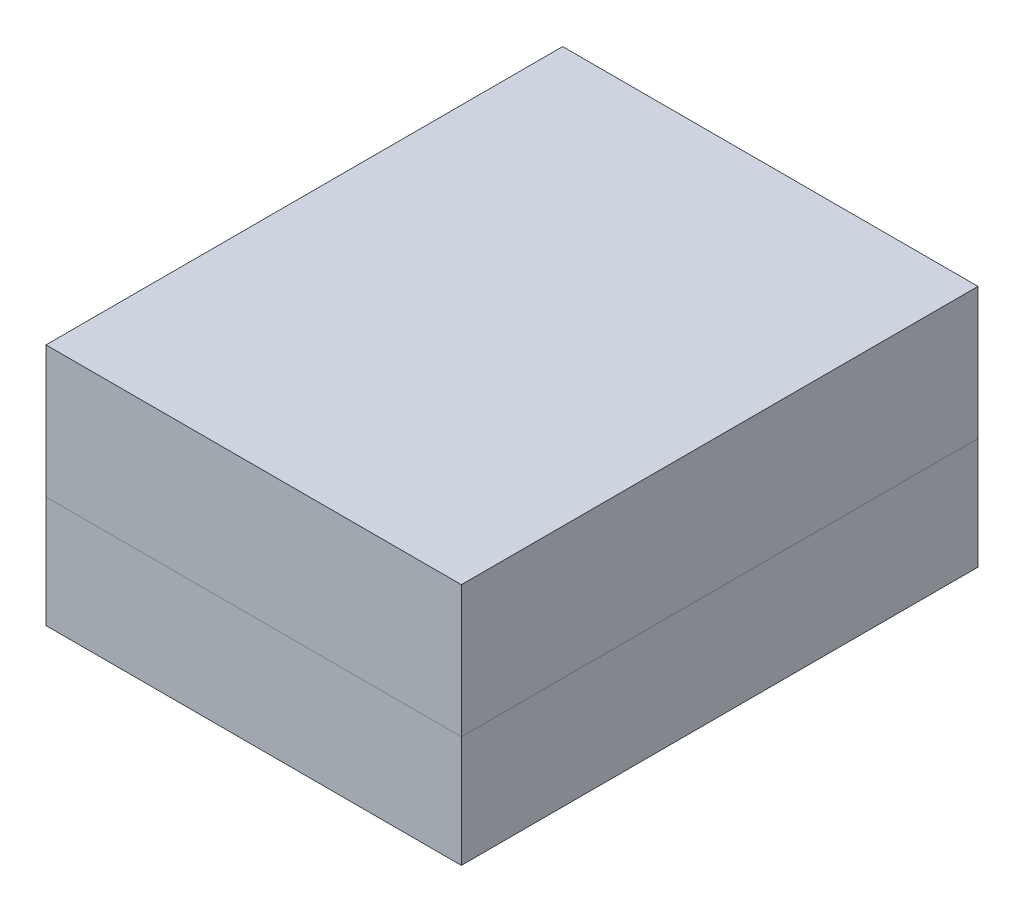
ISO-10303-21;
HEADER;
FILE_DESCRIPTION(('STEP AP214'),'2;1');
FILE_NAME('part.step','',(''),(''),'','','');
FILE_SCHEMA(('AUTOMOTIVE_DESIGN { 1 0 10303 214 1 1 1 1 }'));
ENDSEC;
DATA;
#1=APPLICATION_CONTEXT('core data for automotive mechanical design processes');
#2=APPLICATION_PROTOCOL_DEFINITION('international standard','automotive_design',2000,#1);
#3=PRODUCT_CONTEXT('',#1,'mechanical');
#4=PRODUCT('Part','Part','',(#3));
#5=PRODUCT_RELATED_PRODUCT_CATEGORY('part','',(#4));
#6=PRODUCT_DEFINITION_FORMATION('','',#4);
#7=PRODUCT_DEFINITION_CONTEXT('part definition',#1,'design');
#8=PRODUCT_DEFINITION('design','',#6,#7);
#9=PRODUCT_DEFINITION_SHAPE('','',#8);
#10=(LENGTH_UNIT() NAMED_UNIT(*) SI_UNIT(.MILLI.,.METRE.));
#11=(NAMED_UNIT(*) PLANE_ANGLE_UNIT() SI_UNIT($,.RADIAN.));
#12=(NAMED_UNIT(*) SI_UNIT($,.STERADIAN.) SOLID_ANGLE_UNIT());
#13=UNCERTAINTY_MEASURE_WITH_UNIT(LENGTH_MEASURE(1.E-05),#10,'distance_accuracy_value','');
#14=(GEOMETRIC_REPRESENTATION_CONTEXT(3) GLOBAL_UNCERTAINTY_ASSIGNED_CONTEXT((#13)) GLOBAL_UNIT_ASSIGNED_CONTEXT((#10,
#11,#12)) REPRESENTATION_CONTEXT('',''));
#15=CARTESIAN_POINT('',(0.,0.,0.));
#16=DIRECTION('',(0.,0.,1.));
#17=DIRECTION('',(1.,0.,0.));
#18=AXIS2_PLACEMENT_3D('',#15,#16,#17);
#19=CARTESIAN_POINT('',(-70.8964030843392,0.96,-13.8999023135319));
#20=DIRECTION('',(-1.,0.,0.));
#21=DIRECTION('',(0.,0.,1.));
#22=AXIS2_PLACEMENT_3D('',#19,#20,#21);
#23=PLANE('',#22);
#24=DIRECTION('',(0.,0.,-1.));
#25=VECTOR('',#24,1.);
#26=CARTESIAN_POINT('',(-70.8964030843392,0.44,-13.8999023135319));
#27=LINE('',#26,#25);
#28=CARTESIAN_POINT('',(-70.8964030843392,0.44,-11.8599023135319));
#29=VERTEX_POINT('',#28);
#30=CARTESIAN_POINT('',(-70.8964030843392,0.44,-13.8999023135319));
#31=VERTEX_POINT('',#30);
#32=EDGE_CURVE('E108',#29,#31,#27,.T.);
#33=ORIENTED_EDGE('',*,*,#32,.F.);
#34=DIRECTION('',(0.,-1.,0.));
#35=VECTOR('',#34,1.);
#36=CARTESIAN_POINT('',(-70.8964030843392,0.96,-11.8599023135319));
#37=LINE('',#36,#35);
#38=CARTESIAN_POINT('',(-70.8964030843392,0.96,-11.8599023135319));
#39=VERTEX_POINT('',#38);
#40=EDGE_CURVE('E12',#39,#29,#37,.T.);
#41=ORIENTED_EDGE('',*,*,#40,.F.);
#42=DIRECTION('',(0.,0.,-1.));
#43=VECTOR('',#42,1.);
#44=CARTESIAN_POINT('',(-70.8964030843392,0.96,-13.8999023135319));
#45=LINE('',#44,#43);
#46=CARTESIAN_POINT('',(-70.8964030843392,0.96,-13.8999023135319));
#47=VERTEX_POINT('',#46);
#48=EDGE_CURVE('E102',#39,#47,#45,.T.);
#49=ORIENTED_EDGE('',*,*,#48,.T.);
#50=DIRECTION('',(0.,-1.,0.));
#51=VECTOR('',#50,1.);
#52=CARTESIAN_POINT('',(-70.8964030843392,0.96,-13.8999023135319));
#53=LINE('',#52,#51);
#54=EDGE_CURVE('E47',#47,#31,#53,.T.);
#55=ORIENTED_EDGE('',*,*,#54,.T.);
#56=EDGE_LOOP('',(#33,#41,#49,#55));
#57=FACE_BOUND('',#56,.T.);
#58=ADVANCED_FACE('F44',(#57),#23,.T.);
#59=CARTESIAN_POINT('',(-70.8964030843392,0.96,-11.8599023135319));
#60=DIRECTION('',(0.,0.,1.));
#61=DIRECTION('',(1.,0.,0.));
#62=AXIS2_PLACEMENT_3D('',#59,#60,#61);
#63=PLANE('',#62);
#64=DIRECTION('',(-1.,0.,0.));
#65=VECTOR('',#64,1.);
#66=CARTESIAN_POINT('',(-70.8964030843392,0.44,-11.8599023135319));
#67=LINE('',#66,#65);
#68=CARTESIAN_POINT('',(-69.2564030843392,0.44,-11.8599023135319));
#69=VERTEX_POINT('',#68);
#70=EDGE_CURVE('E104',#69,#29,#67,.T.);
#71=ORIENTED_EDGE('',*,*,#70,.F.);
#72=DIRECTION('',(0.,-1.,0.));
#73=VECTOR('',#72,1.);
#74=CARTESIAN_POINT('',(-69.2564030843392,0.96,-11.8599023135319));
#75=LINE('',#74,#73);
#76=CARTESIAN_POINT('',(-69.2564030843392,0.96,-11.8599023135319));
#77=VERTEX_POINT('',#76);
#78=EDGE_CURVE('E53',#77,#69,#75,.T.);
#79=ORIENTED_EDGE('',*,*,#78,.F.);
#80=DIRECTION('',(-1.,0.,0.));
#81=VECTOR('',#80,1.);
#82=CARTESIAN_POINT('',(-70.8964030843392,0.96,-11.8599023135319));
#83=LINE('',#82,#81);
#84=EDGE_CURVE('E99',#77,#39,#83,.T.);
#85=ORIENTED_EDGE('',*,*,#84,.T.);
#86=ORIENTED_EDGE('',*,*,#40,.T.);
#87=EDGE_LOOP('',(#71,#79,#85,#86));
#88=FACE_BOUND('',#87,.T.);
#89=ADVANCED_FACE('F118',(#88),#63,.T.);
#90=CARTESIAN_POINT('',(-69.2564030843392,0.96,-13.8999023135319));
#91=DIRECTION('',(1.,0.,0.));
#92=DIRECTION('',(0.,0.,-1.));
#93=AXIS2_PLACEMENT_3D('',#90,#91,#92);
#94=PLANE('',#93);
#95=DIRECTION('',(0.,0.,1.));
#96=VECTOR('',#95,1.);
#97=CARTESIAN_POINT('',(-69.2564030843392,0.44,-13.8999023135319));
#98=LINE('',#97,#96);
#99=CARTESIAN_POINT('',(-69.2564030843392,0.44,-13.8999023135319));
#100=VERTEX_POINT('',#99);
#101=EDGE_CURVE('E94',#100,#69,#98,.T.);
#102=ORIENTED_EDGE('',*,*,#101,.F.);
#103=DIRECTION('',(0.,-1.,0.));
#104=VECTOR('',#103,1.);
#105=CARTESIAN_POINT('',(-69.2564030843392,0.96,-13.8999023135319));
#106=LINE('',#105,#104);
#107=CARTESIAN_POINT('',(-69.2564030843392,0.96,-13.8999023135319));
#108=VERTEX_POINT('',#107);
#109=EDGE_CURVE('E89',#108,#100,#106,.T.);
#110=ORIENTED_EDGE('',*,*,#109,.F.);
#111=DIRECTION('',(0.,0.,1.));
#112=VECTOR('',#111,1.);
#113=CARTESIAN_POINT('',(-69.2564030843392,0.96,-13.8999023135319));
#114=LINE('',#113,#112);
#115=EDGE_CURVE('E92',#108,#77,#114,.T.);
#116=ORIENTED_EDGE('',*,*,#115,.T.);
#117=ORIENTED_EDGE('',*,*,#78,.T.);
#118=EDGE_LOOP('',(#102,#110,#116,#117));
#119=FACE_BOUND('',#118,.T.);
#120=ADVANCED_FACE('F91',(#119),#94,.T.);
#121=CARTESIAN_POINT('',(-70.8964030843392,0.96,-13.8999023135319));
#122=DIRECTION('',(0.,0.,-1.));
#123=DIRECTION('',(-1.,0.,0.));
#124=AXIS2_PLACEMENT_3D('',#121,#122,#123);
#125=PLANE('',#124);
#126=DIRECTION('',(1.,0.,0.));
#127=VECTOR('',#126,1.);
#128=CARTESIAN_POINT('',(-70.8964030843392,0.44,-13.8999023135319));
#129=LINE('',#128,#127);
#130=EDGE_CURVE('E111',#31,#100,#129,.T.);
#131=ORIENTED_EDGE('',*,*,#130,.F.);
#132=ORIENTED_EDGE('',*,*,#54,.F.);
#133=DIRECTION('',(1.,0.,0.));
#134=VECTOR('',#133,1.);
#135=CARTESIAN_POINT('',(-70.8964030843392,0.96,-13.8999023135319));
#136=LINE('',#135,#134);
#137=EDGE_CURVE('E98',#47,#108,#136,.T.);
#138=ORIENTED_EDGE('',*,*,#137,.T.);
#139=ORIENTED_EDGE('',*,*,#109,.T.);
#140=EDGE_LOOP('',(#131,#132,#138,#139));
#141=FACE_BOUND('',#140,.T.);
#142=ADVANCED_FACE('F101',(#141),#125,.T.);
#143=CARTESIAN_POINT('',(0.,0.96,0.));
#144=DIRECTION('',(0.,1.,0.));
#145=DIRECTION('',(0.,0.,1.));
#146=AXIS2_PLACEMENT_3D('',#143,#144,#145);
#147=PLANE('',#146);
#148=ORIENTED_EDGE('',*,*,#48,.F.);
#149=ORIENTED_EDGE('',*,*,#84,.F.);
#150=ORIENTED_EDGE('',*,*,#115,.F.);
#151=ORIENTED_EDGE('',*,*,#137,.F.);
#152=EDGE_LOOP('',(#148,#149,#150,#151));
#153=FACE_BOUND('',#152,.T.);
#154=ADVANCED_FACE('F97',(#153),#147,.T.);
#155=CARTESIAN_POINT('',(0.,0.44,0.));
#156=DIRECTION('',(0.,1.,0.));
#157=DIRECTION('',(0.,0.,1.));
#158=AXIS2_PLACEMENT_3D('',#155,#156,#157);
#159=PLANE('',#158);
#160=ORIENTED_EDGE('',*,*,#32,.T.);
#161=ORIENTED_EDGE('',*,*,#130,.T.);
#162=ORIENTED_EDGE('',*,*,#101,.T.);
#163=ORIENTED_EDGE('',*,*,#70,.T.);
#164=EDGE_LOOP('',(#160,#161,#162,#163));
#165=FACE_BOUND('',#164,.T.);
#166=ADVANCED_FACE('F117',(#165),#159,.F.);
#167=CLOSED_SHELL('',(#58,#89,#120,#142,#154,#166));
#168=MANIFOLD_SOLID_BREP('B2',#167);
#169=CARTESIAN_POINT('',(-70.8964030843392,0.44,-13.8999023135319));
#170=DIRECTION('',(1.,0.,0.));
#171=DIRECTION('',(0.,0.,-1.));
#172=AXIS2_PLACEMENT_3D('',#169,#170,#171);
#173=PLANE('',#172);
#174=DIRECTION('',(0.,0.,1.));
#175=VECTOR('',#174,1.);
#176=CARTESIAN_POINT('',(-70.8964030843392,0.,-13.8999023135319));
#177=LINE('',#176,#175);
#178=CARTESIAN_POINT('',(-70.8964030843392,0.,-13.8999023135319));
#179=VERTEX_POINT('',#178);
#180=CARTESIAN_POINT('',(-70.8964030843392,0.,-11.8599023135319));
#181=VERTEX_POINT('',#180);
#182=EDGE_CURVE('E241',#179,#181,#177,.T.);
#183=ORIENTED_EDGE('',*,*,#182,.T.);
#184=DIRECTION('',(0.,-1.,0.));
#185=VECTOR('',#184,1.);
#186=CARTESIAN_POINT('',(-70.8964030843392,0.44,-11.8599023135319));
#187=LINE('',#186,#185);
#188=CARTESIAN_POINT('',(-70.8964030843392,0.44,-11.8599023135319));
#189=VERTEX_POINT('',#188);
#190=EDGE_CURVE('E42',#189,#181,#187,.T.);
#191=ORIENTED_EDGE('',*,*,#190,.F.);
#192=DIRECTION('',(0.,0.,1.));
#193=VECTOR('',#192,1.);
#194=CARTESIAN_POINT('',(-70.8964030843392,0.44,-13.8999023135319));
#195=LINE('',#194,#193);
#196=CARTESIAN_POINT('',(-70.8964030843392,0.44,-13.8999023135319));
#197=VERTEX_POINT('',#196);
#198=EDGE_CURVE('E229',#197,#189,#195,.T.);
#199=ORIENTED_EDGE('',*,*,#198,.F.);
#200=DIRECTION('',(0.,-1.,0.));
#201=VECTOR('',#200,1.);
#202=CARTESIAN_POINT('',(-70.8964030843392,0.44,-13.8999023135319));
#203=LINE('',#202,#201);
#204=EDGE_CURVE('E237',#197,#179,#203,.T.);
#205=ORIENTED_EDGE('',*,*,#204,.T.);
#206=EDGE_LOOP('',(#183,#191,#199,#205));
#207=FACE_BOUND('',#206,.T.);
#208=ADVANCED_FACE('F178',(#207),#173,.F.);
#209=CARTESIAN_POINT('',(-70.8964030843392,0.44,-11.8599023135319));
#210=DIRECTION('',(0.,0.,-1.));
#211=DIRECTION('',(-1.,0.,0.));
#212=AXIS2_PLACEMENT_3D('',#209,#210,#211);
#213=PLANE('',#212);
#214=DIRECTION('',(1.,0.,0.));
#215=VECTOR('',#214,1.);
#216=CARTESIAN_POINT('',(-70.8964030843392,0.,-11.8599023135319));
#217=LINE('',#216,#215);
#218=CARTESIAN_POINT('',(-69.2564030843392,0.,-11.8599023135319));
#219=VERTEX_POINT('',#218);
#220=EDGE_CURVE('E233',#181,#219,#217,.T.);
#221=ORIENTED_EDGE('',*,*,#220,.T.);
#222=DIRECTION('',(0.,-1.,0.));
#223=VECTOR('',#222,1.);
#224=CARTESIAN_POINT('',(-69.2564030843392,0.44,-11.8599023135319));
#225=LINE('',#224,#223);
#226=CARTESIAN_POINT('',(-69.2564030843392,0.44,-11.8599023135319));
#227=VERTEX_POINT('',#226);
#228=EDGE_CURVE('E186',#227,#219,#225,.T.);
#229=ORIENTED_EDGE('',*,*,#228,.F.);
#230=DIRECTION('',(1.,0.,0.));
#231=VECTOR('',#230,1.);
#232=CARTESIAN_POINT('',(-70.8964030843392,0.44,-11.8599023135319));
#233=LINE('',#232,#231);
#234=EDGE_CURVE('E224',#189,#227,#233,.T.);
#235=ORIENTED_EDGE('',*,*,#234,.F.);
#236=ORIENTED_EDGE('',*,*,#190,.T.);
#237=EDGE_LOOP('',(#221,#229,#235,#236));
#238=FACE_BOUND('',#237,.T.);
#239=ADVANCED_FACE('F232',(#238),#213,.F.);
#240=CARTESIAN_POINT('',(-69.2564030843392,0.44,-13.8999023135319));
#241=DIRECTION('',(-1.,0.,0.));
#242=DIRECTION('',(0.,0.,1.));
#243=AXIS2_PLACEMENT_3D('',#240,#241,#242);
#244=PLANE('',#243);
#245=DIRECTION('',(0.,0.,-1.));
#246=VECTOR('',#245,1.);
#247=CARTESIAN_POINT('',(-69.2564030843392,0.,-13.8999023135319));
#248=LINE('',#247,#246);
#249=CARTESIAN_POINT('',(-69.2564030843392,0.,-13.8999023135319));
#250=VERTEX_POINT('',#249);
#251=EDGE_CURVE('E211',#219,#250,#248,.T.);
#252=ORIENTED_EDGE('',*,*,#251,.T.);
#253=DIRECTION('',(0.,-1.,0.));
#254=VECTOR('',#253,1.);
#255=CARTESIAN_POINT('',(-69.2564030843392,0.44,-13.8999023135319));
#256=LINE('',#255,#254);
#257=CARTESIAN_POINT('',(-69.2564030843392,0.44,-13.8999023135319));
#258=VERTEX_POINT('',#257);
#259=EDGE_CURVE('E234',#258,#250,#256,.T.);
#260=ORIENTED_EDGE('',*,*,#259,.F.);
#261=DIRECTION('',(0.,0.,-1.));
#262=VECTOR('',#261,1.);
#263=CARTESIAN_POINT('',(-69.2564030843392,0.44,-13.8999023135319));
#264=LINE('',#263,#262);
#265=EDGE_CURVE('E227',#227,#258,#264,.T.);
#266=ORIENTED_EDGE('',*,*,#265,.F.);
#267=ORIENTED_EDGE('',*,*,#228,.T.);
#268=EDGE_LOOP('',(#252,#260,#266,#267));
#269=FACE_BOUND('',#268,.T.);
#270=ADVANCED_FACE('F235',(#269),#244,.F.);
#271=CARTESIAN_POINT('',(-70.8964030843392,0.44,-13.8999023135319));
#272=DIRECTION('',(0.,0.,1.));
#273=DIRECTION('',(1.,0.,0.));
#274=AXIS2_PLACEMENT_3D('',#271,#272,#273);
#275=PLANE('',#274);
#276=DIRECTION('',(-1.,0.,0.));
#277=VECTOR('',#276,1.);
#278=CARTESIAN_POINT('',(-70.8964030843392,0.,-13.8999023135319));
#279=LINE('',#278,#277);
#280=EDGE_CURVE('E217',#250,#179,#279,.T.);
#281=ORIENTED_EDGE('',*,*,#280,.T.);
#282=ORIENTED_EDGE('',*,*,#204,.F.);
#283=DIRECTION('',(-1.,0.,0.));
#284=VECTOR('',#283,1.);
#285=CARTESIAN_POINT('',(-70.8964030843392,0.44,-13.8999023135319));
#286=LINE('',#285,#284);
#287=EDGE_CURVE('E194',#258,#197,#286,.T.);
#288=ORIENTED_EDGE('',*,*,#287,.F.);
#289=ORIENTED_EDGE('',*,*,#259,.T.);
#290=EDGE_LOOP('',(#281,#282,#288,#289));
#291=FACE_BOUND('',#290,.T.);
#292=ADVANCED_FACE('F248',(#291),#275,.F.);
#293=CARTESIAN_POINT('',(0.,0.44,0.));
#294=DIRECTION('',(0.,1.,0.));
#295=DIRECTION('',(0.,0.,1.));
#296=AXIS2_PLACEMENT_3D('',#293,#294,#295);
#297=PLANE('',#296);
#298=ORIENTED_EDGE('',*,*,#198,.T.);
#299=ORIENTED_EDGE('',*,*,#234,.T.);
#300=ORIENTED_EDGE('',*,*,#265,.T.);
#301=ORIENTED_EDGE('',*,*,#287,.T.);
#302=EDGE_LOOP('',(#298,#299,#300,#301));
#303=FACE_BOUND('',#302,.T.);
#304=ADVANCED_FACE('F225',(#303),#297,.T.);
#305=CARTESIAN_POINT('',(0.,0.,0.));
#306=DIRECTION('',(0.,1.,0.));
#307=DIRECTION('',(0.,0.,1.));
#308=AXIS2_PLACEMENT_3D('',#305,#306,#307);
#309=PLANE('',#308);
#310=ORIENTED_EDGE('',*,*,#182,.F.);
#311=ORIENTED_EDGE('',*,*,#280,.F.);
#312=ORIENTED_EDGE('',*,*,#251,.F.);
#313=ORIENTED_EDGE('',*,*,#220,.F.);
#314=EDGE_LOOP('',(#310,#311,#312,#313));
#315=FACE_BOUND('',#314,.T.);
#316=ADVANCED_FACE('F251',(#315),#309,.F.);
#317=CLOSED_SHELL('',(#208,#239,#270,#292,#304,#316));
#318=MANIFOLD_SOLID_BREP('B6',#317);
#319=CARTESIAN_POINT('',(-69.8014030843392,-0.06,-12.0549023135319));
#320=DIRECTION('',(0.,1.,0.));
#321=DIRECTION('',(0.,0.,1.));
#322=AXIS2_PLACEMENT_3D('',#319,#320,#321);
#323=CYLINDRICAL_SURFACE('',#322,0.100000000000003);
#324=CARTESIAN_POINT('',(-69.8014030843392,0.,-12.0549023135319));
#325=DIRECTION('',(0.,1.,0.));
#326=DIRECTION('',(0.,0.,-1.));
#327=AXIS2_PLACEMENT_3D('',#324,#325,#326);
#328=CIRCLE('',#327,0.100000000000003);
#329=CARTESIAN_POINT('',(-69.9014030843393,0.,-12.0549023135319));
#330=VERTEX_POINT('',#329);
#331=CARTESIAN_POINT('',(-69.8014030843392,0.,-11.9549023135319));
#332=VERTEX_POINT('',#331);
#333=EDGE_CURVE('E409',#330,#332,#328,.T.);
#334=ORIENTED_EDGE('',*,*,#333,.F.);
#335=DIRECTION('',(0.,1.,0.));
#336=VECTOR('',#335,1.);
#337=CARTESIAN_POINT('',(-69.9014030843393,-0.06,-12.0549023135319));
#338=LINE('',#337,#336);
#339=CARTESIAN_POINT('',(-69.9014030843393,-0.06,-12.0549023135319));
#340=VERTEX_POINT('',#339);
#341=EDGE_CURVE('E176',#340,#330,#338,.T.);
#342=ORIENTED_EDGE('',*,*,#341,.F.);
#343=CARTESIAN_POINT('',(-69.8014030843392,-0.06,-12.0549023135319));
#344=DIRECTION('',(0.,1.,0.));
#345=DIRECTION('',(0.,0.,-1.));
#346=AXIS2_PLACEMENT_3D('',#343,#344,#345);
#347=CIRCLE('',#346,0.100000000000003);
#348=CARTESIAN_POINT('',(-69.8014030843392,-0.06,-11.9549023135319));
#349=VERTEX_POINT('',#348);
#350=EDGE_CURVE('E429',#340,#349,#347,.T.);
#351=ORIENTED_EDGE('',*,*,#350,.T.);
#352=DIRECTION('',(0.,1.,0.));
#353=VECTOR('',#352,1.);
#354=CARTESIAN_POINT('',(-69.8014030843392,-0.06,-11.9549023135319));
#355=LINE('',#354,#353);
#356=EDGE_CURVE('E315',#349,#332,#355,.T.);
#357=ORIENTED_EDGE('',*,*,#356,.T.);
#358=EDGE_LOOP('',(#334,#342,#351,#357));
#359=FACE_BOUND('',#358,.T.);
#360=ADVANCED_FACE('F312',(#359),#323,.T.);
#361=CARTESIAN_POINT('',(-69.9014030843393,-0.06,-12.2049023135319));
#362=DIRECTION('',(-1.,0.,0.));
#363=DIRECTION('',(0.,0.,1.));
#364=AXIS2_PLACEMENT_3D('',#361,#362,#363);
#365=PLANE('',#364);
#366=DIRECTION('',(0.,0.,1.));
#367=VECTOR('',#366,1.);
#368=CARTESIAN_POINT('',(-69.9014030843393,0.,-12.2049023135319));
#369=LINE('',#368,#367);
#370=CARTESIAN_POINT('',(-69.9014030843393,0.,-12.2049023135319));
#371=VERTEX_POINT('',#370);
#372=EDGE_CURVE('E427',#371,#330,#369,.T.);
#373=ORIENTED_EDGE('',*,*,#372,.F.);
#374=DIRECTION('',(0.,1.,0.));
#375=VECTOR('',#374,1.);
#376=CARTESIAN_POINT('',(-69.9014030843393,-0.06,-12.2049023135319));
#377=LINE('',#376,#375);
#378=CARTESIAN_POINT('',(-69.9014030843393,-0.06,-12.2049023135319));
#379=VERTEX_POINT('',#378);
#380=EDGE_CURVE('E321',#379,#371,#377,.T.);
#381=ORIENTED_EDGE('',*,*,#380,.F.);
#382=DIRECTION('',(0.,0.,1.));
#383=VECTOR('',#382,1.);
#384=CARTESIAN_POINT('',(-69.9014030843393,-0.06,-12.2049023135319));
#385=LINE('',#384,#383);
#386=EDGE_CURVE('E399',#379,#340,#385,.T.);
#387=ORIENTED_EDGE('',*,*,#386,.T.);
#388=ORIENTED_EDGE('',*,*,#341,.T.);
#389=EDGE_LOOP('',(#373,#381,#387,#388));
#390=FACE_BOUND('',#389,.T.);
#391=ADVANCED_FACE('F441',(#390),#365,.T.);
#392=CARTESIAN_POINT('',(-69.8014030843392,-0.06,-12.2049023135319));
#393=DIRECTION('',(0.,1.,0.));
#394=DIRECTION('',(0.,0.,1.));
#395=AXIS2_PLACEMENT_3D('',#392,#393,#394);
#396=CYLINDRICAL_SURFACE('',#395,0.100000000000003);
#397=CARTESIAN_POINT('',(-69.8014030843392,0.,-12.2049023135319));
#398=DIRECTION('',(0.,1.,0.));
#399=DIRECTION('',(0.,0.,-1.));
#400=AXIS2_PLACEMENT_3D('',#397,#398,#399);
#401=CIRCLE('',#400,0.100000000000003);
#402=CARTESIAN_POINT('',(-69.8014030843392,0.,-12.3049023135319));
#403=VERTEX_POINT('',#402);
#404=EDGE_CURVE('E386',#403,#371,#401,.T.);
#405=ORIENTED_EDGE('',*,*,#404,.F.);
#406=DIRECTION('',(0.,1.,0.));
#407=VECTOR('',#406,1.);
#408=CARTESIAN_POINT('',(-69.8014030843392,-0.06,-12.3049023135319));
#409=LINE('',#408,#407);
#410=CARTESIAN_POINT('',(-69.8014030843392,-0.06,-12.3049023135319));
#411=VERTEX_POINT('',#410);
#412=EDGE_CURVE('E381',#411,#403,#409,.T.);
#413=ORIENTED_EDGE('',*,*,#412,.F.);
#414=CARTESIAN_POINT('',(-69.8014030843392,-0.06,-12.2049023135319));
#415=DIRECTION('',(0.,1.,0.));
#416=DIRECTION('',(0.,0.,-1.));
#417=AXIS2_PLACEMENT_3D('',#414,#415,#416);
#418=CIRCLE('',#417,0.100000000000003);
#419=EDGE_CURVE('E384',#411,#379,#418,.T.);
#420=ORIENTED_EDGE('',*,*,#419,.T.);
#421=ORIENTED_EDGE('',*,*,#380,.T.);
#422=EDGE_LOOP('',(#405,#413,#420,#421));
#423=FACE_BOUND('',#422,.T.);
#424=ADVANCED_FACE('F383',(#423),#396,.T.);
#425=CARTESIAN_POINT('',(-69.8014030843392,-0.06,-12.3049023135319));
#426=DIRECTION('',(0.,0.,-1.));
#427=DIRECTION('',(-1.,0.,0.));
#428=AXIS2_PLACEMENT_3D('',#425,#426,#427);
#429=PLANE('',#428);
#430=DIRECTION('',(-1.,0.,0.));
#431=VECTOR('',#430,1.);
#432=CARTESIAN_POINT('',(-69.8014030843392,0.,-12.3049023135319));
#433=LINE('',#432,#431);
#434=CARTESIAN_POINT('',(-69.4514030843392,0.,-12.3049023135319));
#435=VERTEX_POINT('',#434);
#436=EDGE_CURVE('E424',#435,#403,#433,.T.);
#437=ORIENTED_EDGE('',*,*,#436,.F.);
#438=DIRECTION('',(0.,1.,0.));
#439=VECTOR('',#438,1.);
#440=CARTESIAN_POINT('',(-69.4514030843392,-0.06,-12.3049023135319));
#441=LINE('',#440,#439);
#442=CARTESIAN_POINT('',(-69.4514030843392,-0.06,-12.3049023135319));
#443=VERTEX_POINT('',#442);
#444=EDGE_CURVE('E391',#443,#435,#441,.T.);
#445=ORIENTED_EDGE('',*,*,#444,.F.);
#446=DIRECTION('',(-1.,0.,0.));
#447=VECTOR('',#446,1.);
#448=CARTESIAN_POINT('',(-69.8014030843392,-0.06,-12.3049023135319));
#449=LINE('',#448,#447);
#450=EDGE_CURVE('E397',#443,#411,#449,.T.);
#451=ORIENTED_EDGE('',*,*,#450,.T.);
#452=ORIENTED_EDGE('',*,*,#412,.T.);
#453=EDGE_LOOP('',(#437,#445,#451,#452));
#454=FACE_BOUND('',#453,.T.);
#455=ADVANCED_FACE('F401',(#454),#429,.T.);
#456=CARTESIAN_POINT('',(-69.4514030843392,-0.06,-12.2049023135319));
#457=DIRECTION('',(0.,1.,0.));
#458=DIRECTION('',(0.,0.,1.));
#459=AXIS2_PLACEMENT_3D('',#456,#457,#458);
#460=CYLINDRICAL_SURFACE('',#459,0.100000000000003);
#461=CARTESIAN_POINT('',(-69.4514030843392,0.,-12.2049023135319));
#462=DIRECTION('',(0.,1.,0.));
#463=DIRECTION('',(0.,0.,1.));
#464=AXIS2_PLACEMENT_3D('',#461,#462,#463);
#465=CIRCLE('',#464,0.100000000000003);
#466=CARTESIAN_POINT('',(-69.3514030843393,0.,-12.2049023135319));
#467=VERTEX_POINT('',#466);
#468=EDGE_CURVE('E421',#467,#435,#465,.T.);
#469=ORIENTED_EDGE('',*,*,#468,.F.);
#470=DIRECTION('',(0.,1.,0.));
#471=VECTOR('',#470,1.);
#472=CARTESIAN_POINT('',(-69.3514030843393,-0.06,-12.2049023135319));
#473=LINE('',#472,#471);
#474=CARTESIAN_POINT('',(-69.3514030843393,-0.06,-12.2049023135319));
#475=VERTEX_POINT('',#474);
#476=EDGE_CURVE('E433',#475,#467,#473,.T.);
#477=ORIENTED_EDGE('',*,*,#476,.F.);
#478=CARTESIAN_POINT('',(-69.4514030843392,-0.06,-12.2049023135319));
#479=DIRECTION('',(0.,1.,0.));
#480=DIRECTION('',(0.,0.,1.));
#481=AXIS2_PLACEMENT_3D('',#478,#479,#480);
#482=CIRCLE('',#481,0.100000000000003);
#483=EDGE_CURVE('E402',#475,#443,#482,.T.);
#484=ORIENTED_EDGE('',*,*,#483,.T.);
#485=ORIENTED_EDGE('',*,*,#444,.T.);
#486=EDGE_LOOP('',(#469,#477,#484,#485));
#487=FACE_BOUND('',#486,.T.);
#488=ADVANCED_FACE('F454',(#487),#460,.T.);
#489=CARTESIAN_POINT('',(-69.3514030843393,-0.06,-12.2049023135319));
#490=DIRECTION('',(1.,0.,0.));
#491=DIRECTION('',(0.,0.,-1.));
#492=AXIS2_PLACEMENT_3D('',#489,#490,#491);
#493=PLANE('',#492);
#494=DIRECTION('',(0.,0.,-1.));
#495=VECTOR('',#494,1.);
#496=CARTESIAN_POINT('',(-69.3514030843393,0.,-12.2049023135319));
#497=LINE('',#496,#495);
#498=CARTESIAN_POINT('',(-69.3514030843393,0.,-12.0549023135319));
#499=VERTEX_POINT('',#498);
#500=EDGE_CURVE('E418',#499,#467,#497,.T.);
#501=ORIENTED_EDGE('',*,*,#500,.F.);
#502=DIRECTION('',(0.,1.,0.));
#503=VECTOR('',#502,1.);
#504=CARTESIAN_POINT('',(-69.3514030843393,-0.06,-12.0549023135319));
#505=LINE('',#504,#503);
#506=CARTESIAN_POINT('',(-69.3514030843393,-0.06,-12.0549023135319));
#507=VERTEX_POINT('',#506);
#508=EDGE_CURVE('E435',#507,#499,#505,.T.);
#509=ORIENTED_EDGE('',*,*,#508,.F.);
#510=DIRECTION('',(0.,0.,-1.));
#511=VECTOR('',#510,1.);
#512=CARTESIAN_POINT('',(-69.3514030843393,-0.06,-12.2049023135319));
#513=LINE('',#512,#511);
#514=EDGE_CURVE('E404',#507,#475,#513,.T.);
#515=ORIENTED_EDGE('',*,*,#514,.T.);
#516=ORIENTED_EDGE('',*,*,#476,.T.);
#517=EDGE_LOOP('',(#501,#509,#515,#516));
#518=FACE_BOUND('',#517,.T.);
#519=ADVANCED_FACE('F457',(#518),#493,.T.);
#520=CARTESIAN_POINT('',(-69.4514030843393,-0.06,-12.0549023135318));
#521=DIRECTION('',(0.,1.,0.));
#522=DIRECTION('',(0.,0.,1.));
#523=AXIS2_PLACEMENT_3D('',#520,#521,#522);
#524=CYLINDRICAL_SURFACE('',#523,0.0999999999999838);
#525=CARTESIAN_POINT('',(-69.4514030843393,0.,-12.0549023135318));
#526=DIRECTION('',(0.,1.,0.));
#527=DIRECTION('',(0.,0.,-1.));
#528=AXIS2_PLACEMENT_3D('',#525,#526,#527);
#529=CIRCLE('',#528,0.0999999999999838);
#530=CARTESIAN_POINT('',(-69.4514030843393,0.,-11.9549023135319));
#531=VERTEX_POINT('',#530);
#532=EDGE_CURVE('E415',#531,#499,#529,.T.);
#533=ORIENTED_EDGE('',*,*,#532,.F.);
#534=DIRECTION('',(0.,1.,0.));
#535=VECTOR('',#534,1.);
#536=CARTESIAN_POINT('',(-69.4514030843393,-0.06,-11.9549023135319));
#537=LINE('',#536,#535);
#538=CARTESIAN_POINT('',(-69.4514030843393,-0.06,-11.9549023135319));
#539=VERTEX_POINT('',#538);
#540=EDGE_CURVE('E436',#539,#531,#537,.T.);
#541=ORIENTED_EDGE('',*,*,#540,.F.);
#542=CARTESIAN_POINT('',(-69.4514030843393,-0.06,-12.0549023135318));
#543=DIRECTION('',(0.,1.,0.));
#544=DIRECTION('',(0.,0.,-1.));
#545=AXIS2_PLACEMENT_3D('',#542,#543,#544);
#546=CIRCLE('',#545,0.0999999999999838);
#547=EDGE_CURVE('E532',#539,#507,#546,.T.);
#548=ORIENTED_EDGE('',*,*,#547,.T.);
#549=ORIENTED_EDGE('',*,*,#508,.T.);
#550=EDGE_LOOP('',(#533,#541,#548,#549));
#551=FACE_BOUND('',#550,.T.);
#552=ADVANCED_FACE('F461',(#551),#524,.T.);
#553=CARTESIAN_POINT('',(-69.8014030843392,-0.06,-11.9549023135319));
#554=DIRECTION('',(0.,0.,1.));
#555=DIRECTION('',(1.,0.,0.));
#556=AXIS2_PLACEMENT_3D('',#553,#554,#555);
#557=PLANE('',#556);
#558=DIRECTION('',(1.,0.,0.));
#559=VECTOR('',#558,1.);
#560=CARTESIAN_POINT('',(-69.8014030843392,0.,-11.9549023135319));
#561=LINE('',#560,#559);
#562=EDGE_CURVE('E412',#332,#531,#561,.T.);
#563=ORIENTED_EDGE('',*,*,#562,.F.);
#564=ORIENTED_EDGE('',*,*,#356,.F.);
#565=DIRECTION('',(1.,0.,0.));
#566=VECTOR('',#565,1.);
#567=CARTESIAN_POINT('',(-69.8014030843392,-0.06,-11.9549023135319));
#568=LINE('',#567,#566);
#569=EDGE_CURVE('E533',#349,#539,#568,.T.);
#570=ORIENTED_EDGE('',*,*,#569,.T.);
#571=ORIENTED_EDGE('',*,*,#540,.T.);
#572=EDGE_LOOP('',(#563,#564,#570,#571));
#573=FACE_BOUND('',#572,.T.);
#574=ADVANCED_FACE('F438',(#573),#557,.T.);
#575=CARTESIAN_POINT('',(-69.8014030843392,-0.06,-12.0549023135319));
#576=DIRECTION('',(0.,-1.,0.));
#577=DIRECTION('',(0.,0.,-1.));
#578=AXIS2_PLACEMENT_3D('',#575,#576,#577);
#579=PLANE('',#578);
#580=ORIENTED_EDGE('',*,*,#350,.F.);
#581=ORIENTED_EDGE('',*,*,#386,.F.);
#582=ORIENTED_EDGE('',*,*,#419,.F.);
#583=ORIENTED_EDGE('',*,*,#450,.F.);
#584=ORIENTED_EDGE('',*,*,#483,.F.);
#585=ORIENTED_EDGE('',*,*,#514,.F.);
#586=ORIENTED_EDGE('',*,*,#547,.F.);
#587=ORIENTED_EDGE('',*,*,#569,.F.);
#588=EDGE_LOOP('',(#580,#581,#582,#583,#584,#585,#586,#587));
#589=FACE_BOUND('',#588,.T.);
#590=ADVANCED_FACE('F395',(#589),#579,.T.);
#591=CARTESIAN_POINT('',(-69.8014030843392,0.,-12.0549023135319));
#592=DIRECTION('',(0.,-1.,0.));
#593=DIRECTION('',(0.,0.,-1.));
#594=AXIS2_PLACEMENT_3D('',#591,#592,#593);
#595=PLANE('',#594);
#596=ORIENTED_EDGE('',*,*,#333,.T.);
#597=ORIENTED_EDGE('',*,*,#562,.T.);
#598=ORIENTED_EDGE('',*,*,#532,.T.);
#599=ORIENTED_EDGE('',*,*,#500,.T.);
#600=ORIENTED_EDGE('',*,*,#468,.T.);
#601=ORIENTED_EDGE('',*,*,#436,.T.);
#602=ORIENTED_EDGE('',*,*,#404,.T.);
#603=ORIENTED_EDGE('',*,*,#372,.T.);
#604=EDGE_LOOP('',(#596,#597,#598,#599,#600,#601,#602,#603));
#605=FACE_BOUND('',#604,.T.);
#606=ADVANCED_FACE('F440',(#605),#595,.F.);
#607=CLOSED_SHELL('',(#360,#391,#424,#455,#488,#519,#552,#574,#590,#606));
#608=MANIFOLD_SOLID_BREP('B36',#607);
#609=CARTESIAN_POINT('',(-70.7014030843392,-0.06,-12.0549023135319));
#610=DIRECTION('',(0.,1.,0.));
#611=DIRECTION('',(0.,0.,1.));
#612=AXIS2_PLACEMENT_3D('',#609,#610,#611);
#613=CYLINDRICAL_SURFACE('',#612,0.100000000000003);
#614=CARTESIAN_POINT('',(-70.7014030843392,0.,-12.0549023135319));
#615=DIRECTION('',(0.,1.,0.));
#616=DIRECTION('',(0.,0.,-1.));
#617=AXIS2_PLACEMENT_3D('',#614,#615,#616);
#618=CIRCLE('',#617,0.100000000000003);
#619=CARTESIAN_POINT('',(-70.8014030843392,0.,-12.0549023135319));
#620=VERTEX_POINT('',#619);
#621=CARTESIAN_POINT('',(-70.7014030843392,0.,-11.9549023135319));
#622=VERTEX_POINT('',#621);
#623=EDGE_CURVE('E646',#620,#622,#618,.T.);
#624=ORIENTED_EDGE('',*,*,#623,.F.);
#625=DIRECTION('',(0.,1.,0.));
#626=VECTOR('',#625,1.);
#627=CARTESIAN_POINT('',(-70.8014030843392,-0.06,-12.0549023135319));
#628=LINE('',#627,#626);
#629=CARTESIAN_POINT('',(-70.8014030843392,-0.06,-12.0549023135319));
#630=VERTEX_POINT('',#629);
#631=EDGE_CURVE('E310',#630,#620,#628,.T.);
#632=ORIENTED_EDGE('',*,*,#631,.F.);
#633=CARTESIAN_POINT('',(-70.7014030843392,-0.06,-12.0549023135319));
#634=DIRECTION('',(0.,1.,0.));
#635=DIRECTION('',(0.,0.,-1.));
#636=AXIS2_PLACEMENT_3D('',#633,#634,#635);
#637=CIRCLE('',#636,0.100000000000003);
#638=CARTESIAN_POINT('',(-70.7014030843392,-0.06,-11.9549023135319));
#639=VERTEX_POINT('',#638);
#640=EDGE_CURVE('E666',#630,#639,#637,.T.);
#641=ORIENTED_EDGE('',*,*,#640,.T.);
#642=DIRECTION('',(0.,1.,0.));
#643=VECTOR('',#642,1.);
#644=CARTESIAN_POINT('',(-70.7014030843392,-0.06,-11.9549023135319));
#645=LINE('',#644,#643);
#646=EDGE_CURVE('E552',#639,#622,#645,.T.);
#647=ORIENTED_EDGE('',*,*,#646,.T.);
#648=EDGE_LOOP('',(#624,#632,#641,#647));
#649=FACE_BOUND('',#648,.T.);
#650=ADVANCED_FACE('F549',(#649),#613,.T.);
#651=CARTESIAN_POINT('',(-70.8014030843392,-0.06,-12.2049023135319));
#652=DIRECTION('',(-1.,0.,0.));
#653=DIRECTION('',(0.,0.,1.));
#654=AXIS2_PLACEMENT_3D('',#651,#652,#653);
#655=PLANE('',#654);
#656=DIRECTION('',(0.,0.,1.));
#657=VECTOR('',#656,1.);
#658=CARTESIAN_POINT('',(-70.8014030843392,0.,-12.2049023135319));
#659=LINE('',#658,#657);
#660=CARTESIAN_POINT('',(-70.8014030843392,0.,-12.2049023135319));
#661=VERTEX_POINT('',#660);
#662=EDGE_CURVE('E664',#661,#620,#659,.T.);
#663=ORIENTED_EDGE('',*,*,#662,.F.);
#664=DIRECTION('',(0.,1.,0.));
#665=VECTOR('',#664,1.);
#666=CARTESIAN_POINT('',(-70.8014030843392,-0.06,-12.2049023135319));
#667=LINE('',#666,#665);
#668=CARTESIAN_POINT('',(-70.8014030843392,-0.06,-12.2049023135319));
#669=VERTEX_POINT('',#668);
#670=EDGE_CURVE('E558',#669,#661,#667,.T.);
#671=ORIENTED_EDGE('',*,*,#670,.F.);
#672=DIRECTION('',(0.,0.,1.));
#673=VECTOR('',#672,1.);
#674=CARTESIAN_POINT('',(-70.8014030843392,-0.06,-12.2049023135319));
#675=LINE('',#674,#673);
#676=EDGE_CURVE('E636',#669,#630,#675,.T.);
#677=ORIENTED_EDGE('',*,*,#676,.T.);
#678=ORIENTED_EDGE('',*,*,#631,.T.);
#679=EDGE_LOOP('',(#663,#671,#677,#678));
#680=FACE_BOUND('',#679,.T.);
#681=ADVANCED_FACE('F678',(#680),#655,.T.);
#682=CARTESIAN_POINT('',(-70.7014030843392,-0.06,-12.2049023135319));
#683=DIRECTION('',(0.,1.,0.));
#684=DIRECTION('',(0.,0.,1.));
#685=AXIS2_PLACEMENT_3D('',#682,#683,#684);
#686=CYLINDRICAL_SURFACE('',#685,0.100000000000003);
#687=CARTESIAN_POINT('',(-70.7014030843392,0.,-12.2049023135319));
#688=DIRECTION('',(0.,1.,0.));
#689=DIRECTION('',(0.,0.,-1.));
#690=AXIS2_PLACEMENT_3D('',#687,#688,#689);
#691=CIRCLE('',#690,0.100000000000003);
#692=CARTESIAN_POINT('',(-70.7014030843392,0.,-12.3049023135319));
#693=VERTEX_POINT('',#692);
#694=EDGE_CURVE('E623',#693,#661,#691,.T.);
#695=ORIENTED_EDGE('',*,*,#694,.F.);
#696=DIRECTION('',(0.,1.,0.));
#697=VECTOR('',#696,1.);
#698=CARTESIAN_POINT('',(-70.7014030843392,-0.06,-12.3049023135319));
#699=LINE('',#698,#697);
#700=CARTESIAN_POINT('',(-70.7014030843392,-0.06,-12.3049023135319));
#701=VERTEX_POINT('',#700);
#702=EDGE_CURVE('E618',#701,#693,#699,.T.);
#703=ORIENTED_EDGE('',*,*,#702,.F.);
#704=CARTESIAN_POINT('',(-70.7014030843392,-0.06,-12.2049023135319));
#705=DIRECTION('',(0.,1.,0.));
#706=DIRECTION('',(0.,0.,-1.));
#707=AXIS2_PLACEMENT_3D('',#704,#705,#706);
#708=CIRCLE('',#707,0.100000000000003);
#709=EDGE_CURVE('E621',#701,#669,#708,.T.);
#710=ORIENTED_EDGE('',*,*,#709,.T.);
#711=ORIENTED_EDGE('',*,*,#670,.T.);
#712=EDGE_LOOP('',(#695,#703,#710,#711));
#713=FACE_BOUND('',#712,.T.);
#714=ADVANCED_FACE('F620',(#713),#686,.T.);
#715=CARTESIAN_POINT('',(-70.7014030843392,-0.06,-12.3049023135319));
#716=DIRECTION('',(0.,0.,-1.));
#717=DIRECTION('',(-1.,0.,0.));
#718=AXIS2_PLACEMENT_3D('',#715,#716,#717);
#719=PLANE('',#718);
#720=DIRECTION('',(-1.,0.,0.));
#721=VECTOR('',#720,1.);
#722=CARTESIAN_POINT('',(-70.7014030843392,0.,-12.3049023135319));
#723=LINE('',#722,#721);
#724=CARTESIAN_POINT('',(-70.3514030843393,0.,-12.3049023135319));
#725=VERTEX_POINT('',#724);
#726=EDGE_CURVE('E661',#725,#693,#723,.T.);
#727=ORIENTED_EDGE('',*,*,#726,.F.);
#728=DIRECTION('',(0.,1.,0.));
#729=VECTOR('',#728,1.);
#730=CARTESIAN_POINT('',(-70.3514030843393,-0.06,-12.3049023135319));
#731=LINE('',#730,#729);
#732=CARTESIAN_POINT('',(-70.3514030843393,-0.06,-12.3049023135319));
#733=VERTEX_POINT('',#732);
#734=EDGE_CURVE('E628',#733,#725,#731,.T.);
#735=ORIENTED_EDGE('',*,*,#734,.F.);
#736=DIRECTION('',(-1.,0.,0.));
#737=VECTOR('',#736,1.);
#738=CARTESIAN_POINT('',(-70.7014030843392,-0.06,-12.3049023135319));
#739=LINE('',#738,#737);
#740=EDGE_CURVE('E634',#733,#701,#739,.T.);
#741=ORIENTED_EDGE('',*,*,#740,.T.);
#742=ORIENTED_EDGE('',*,*,#702,.T.);
#743=EDGE_LOOP('',(#727,#735,#741,#742));
#744=FACE_BOUND('',#743,.T.);
#745=ADVANCED_FACE('F638',(#744),#719,.T.);
#746=CARTESIAN_POINT('',(-70.3514030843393,-0.06,-12.2049023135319));
#747=DIRECTION('',(0.,1.,0.));
#748=DIRECTION('',(0.,0.,1.));
#749=AXIS2_PLACEMENT_3D('',#746,#747,#748);
#750=CYLINDRICAL_SURFACE('',#749,0.100000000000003);
#751=CARTESIAN_POINT('',(-70.3514030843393,0.,-12.2049023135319));
#752=DIRECTION('',(0.,1.,0.));
#753=DIRECTION('',(0.,0.,1.));
#754=AXIS2_PLACEMENT_3D('',#751,#752,#753);
#755=CIRCLE('',#754,0.100000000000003);
#756=CARTESIAN_POINT('',(-70.2514030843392,0.,-12.2049023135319));
#757=VERTEX_POINT('',#756);
#758=EDGE_CURVE('E658',#757,#725,#755,.T.);
#759=ORIENTED_EDGE('',*,*,#758,.F.);
#760=DIRECTION('',(0.,1.,0.));
#761=VECTOR('',#760,1.);
#762=CARTESIAN_POINT('',(-70.2514030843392,-0.06,-12.2049023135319));
#763=LINE('',#762,#761);
#764=CARTESIAN_POINT('',(-70.2514030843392,-0.06,-12.2049023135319));
#765=VERTEX_POINT('',#764);
#766=EDGE_CURVE('E670',#765,#757,#763,.T.);
#767=ORIENTED_EDGE('',*,*,#766,.F.);
#768=CARTESIAN_POINT('',(-70.3514030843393,-0.06,-12.2049023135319));
#769=DIRECTION('',(0.,1.,0.));
#770=DIRECTION('',(0.,0.,1.));
#771=AXIS2_PLACEMENT_3D('',#768,#769,#770);
#772=CIRCLE('',#771,0.100000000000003);
#773=EDGE_CURVE('E639',#765,#733,#772,.T.);
#774=ORIENTED_EDGE('',*,*,#773,.T.);
#775=ORIENTED_EDGE('',*,*,#734,.T.);
#776=EDGE_LOOP('',(#759,#767,#774,#775));
#777=FACE_BOUND('',#776,.T.);
#778=ADVANCED_FACE('F691',(#777),#750,.T.);
#779=CARTESIAN_POINT('',(-70.2514030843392,-0.06,-12.2049023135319));
#780=DIRECTION('',(1.,0.,0.));
#781=DIRECTION('',(0.,0.,-1.));
#782=AXIS2_PLACEMENT_3D('',#779,#780,#781);
#783=PLANE('',#782);
#784=DIRECTION('',(0.,0.,-1.));
#785=VECTOR('',#784,1.);
#786=CARTESIAN_POINT('',(-70.2514030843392,0.,-12.2049023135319));
#787=LINE('',#786,#785);
#788=CARTESIAN_POINT('',(-70.2514030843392,0.,-12.0549023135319));
#789=VERTEX_POINT('',#788);
#790=EDGE_CURVE('E655',#789,#757,#787,.T.);
#791=ORIENTED_EDGE('',*,*,#790,.F.);
#792=DIRECTION('',(0.,1.,0.));
#793=VECTOR('',#792,1.);
#794=CARTESIAN_POINT('',(-70.2514030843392,-0.06,-12.0549023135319));
#795=LINE('',#794,#793);
#796=CARTESIAN_POINT('',(-70.2514030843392,-0.06,-12.0549023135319));
#797=VERTEX_POINT('',#796);
#798=EDGE_CURVE('E672',#797,#789,#795,.T.);
#799=ORIENTED_EDGE('',*,*,#798,.F.);
#800=DIRECTION('',(0.,0.,-1.));
#801=VECTOR('',#800,1.);
#802=CARTESIAN_POINT('',(-70.2514030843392,-0.06,-12.2049023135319));
#803=LINE('',#802,#801);
#804=EDGE_CURVE('E641',#797,#765,#803,.T.);
#805=ORIENTED_EDGE('',*,*,#804,.T.);
#806=ORIENTED_EDGE('',*,*,#766,.T.);
#807=EDGE_LOOP('',(#791,#799,#805,#806));
#808=FACE_BOUND('',#807,.T.);
#809=ADVANCED_FACE('F694',(#808),#783,.T.);
#810=CARTESIAN_POINT('',(-70.3514030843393,-0.06,-12.0549023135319));
#811=DIRECTION('',(0.,1.,0.));
#812=DIRECTION('',(0.,0.,1.));
#813=AXIS2_PLACEMENT_3D('',#810,#811,#812);
#814=CYLINDRICAL_SURFACE('',#813,0.100000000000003);
#815=CARTESIAN_POINT('',(-70.3514030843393,0.,-12.0549023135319));
#816=DIRECTION('',(0.,1.,0.));
#817=DIRECTION('',(0.,0.,-1.));
#818=AXIS2_PLACEMENT_3D('',#815,#816,#817);
#819=CIRCLE('',#818,0.100000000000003);
#820=CARTESIAN_POINT('',(-70.3514030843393,0.,-11.9549023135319));
#821=VERTEX_POINT('',#820);
#822=EDGE_CURVE('E652',#821,#789,#819,.T.);
#823=ORIENTED_EDGE('',*,*,#822,.F.);
#824=DIRECTION('',(0.,1.,0.));
#825=VECTOR('',#824,1.);
#826=CARTESIAN_POINT('',(-70.3514030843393,-0.06,-11.9549023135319));
#827=LINE('',#826,#825);
#828=CARTESIAN_POINT('',(-70.3514030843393,-0.06,-11.9549023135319));
#829=VERTEX_POINT('',#828);
#830=EDGE_CURVE('E673',#829,#821,#827,.T.);
#831=ORIENTED_EDGE('',*,*,#830,.F.);
#832=CARTESIAN_POINT('',(-70.3514030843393,-0.06,-12.0549023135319));
#833=DIRECTION('',(0.,1.,0.));
#834=DIRECTION('',(0.,0.,-1.));
#835=AXIS2_PLACEMENT_3D('',#832,#833,#834);
#836=CIRCLE('',#835,0.100000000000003);
#837=EDGE_CURVE('E769',#829,#797,#836,.T.);
#838=ORIENTED_EDGE('',*,*,#837,.T.);
#839=ORIENTED_EDGE('',*,*,#798,.T.);
#840=EDGE_LOOP('',(#823,#831,#838,#839));
#841=FACE_BOUND('',#840,.T.);
#842=ADVANCED_FACE('F698',(#841),#814,.T.);
#843=CARTESIAN_POINT('',(-70.7014030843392,-0.06,-11.9549023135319));
#844=DIRECTION('',(0.,0.,1.));
#845=DIRECTION('',(1.,0.,0.));
#846=AXIS2_PLACEMENT_3D('',#843,#844,#845);
#847=PLANE('',#846);
#848=DIRECTION('',(1.,0.,0.));
#849=VECTOR('',#848,1.);
#850=CARTESIAN_POINT('',(-70.7014030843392,0.,-11.9549023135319));
#851=LINE('',#850,#849);
#852=EDGE_CURVE('E649',#622,#821,#851,.T.);
#853=ORIENTED_EDGE('',*,*,#852,.F.);
#854=ORIENTED_EDGE('',*,*,#646,.F.);
#855=DIRECTION('',(1.,0.,0.));
#856=VECTOR('',#855,1.);
#857=CARTESIAN_POINT('',(-70.7014030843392,-0.06,-11.9549023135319));
#858=LINE('',#857,#856);
#859=EDGE_CURVE('E770',#639,#829,#858,.T.);
#860=ORIENTED_EDGE('',*,*,#859,.T.);
#861=ORIENTED_EDGE('',*,*,#830,.T.);
#862=EDGE_LOOP('',(#853,#854,#860,#861));
#863=FACE_BOUND('',#862,.T.);
#864=ADVANCED_FACE('F675',(#863),#847,.T.);
#865=CARTESIAN_POINT('',(-70.7014030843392,-0.06,-12.0549023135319));
#866=DIRECTION('',(0.,-1.,0.));
#867=DIRECTION('',(0.,0.,-1.));
#868=AXIS2_PLACEMENT_3D('',#865,#866,#867);
#869=PLANE('',#868);
#870=ORIENTED_EDGE('',*,*,#640,.F.);
#871=ORIENTED_EDGE('',*,*,#676,.F.);
#872=ORIENTED_EDGE('',*,*,#709,.F.);
#873=ORIENTED_EDGE('',*,*,#740,.F.);
#874=ORIENTED_EDGE('',*,*,#773,.F.);
#875=ORIENTED_EDGE('',*,*,#804,.F.);
#876=ORIENTED_EDGE('',*,*,#837,.F.);
#877=ORIENTED_EDGE('',*,*,#859,.F.);
#878=EDGE_LOOP('',(#870,#871,#872,#873,#874,#875,#876,#877));
#879=FACE_BOUND('',#878,.T.);
#880=ADVANCED_FACE('F632',(#879),#869,.T.);
#881=CARTESIAN_POINT('',(-70.7014030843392,0.,-12.0549023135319));
#882=DIRECTION('',(0.,-1.,0.));
#883=DIRECTION('',(0.,0.,-1.));
#884=AXIS2_PLACEMENT_3D('',#881,#882,#883);
#885=PLANE('',#884);
#886=ORIENTED_EDGE('',*,*,#623,.T.);
#887=ORIENTED_EDGE('',*,*,#852,.T.);
#888=ORIENTED_EDGE('',*,*,#822,.T.);
#889=ORIENTED_EDGE('',*,*,#790,.T.);
#890=ORIENTED_EDGE('',*,*,#758,.T.);
#891=ORIENTED_EDGE('',*,*,#726,.T.);
#892=ORIENTED_EDGE('',*,*,#694,.T.);
#893=ORIENTED_EDGE('',*,*,#662,.T.);
#894=EDGE_LOOP('',(#886,#887,#888,#889,#890,#891,#892,#893));
#895=FACE_BOUND('',#894,.T.);
#896=ADVANCED_FACE('F677',(#895),#885,.F.);
#897=CLOSED_SHELL('',(#650,#681,#714,#745,#778,#809,#842,#864,#880,#896));
#898=MANIFOLD_SOLID_BREP('B170',#897);
#899=CARTESIAN_POINT('',(-69.4514030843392,-0.06,-12.6549023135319));
#900=DIRECTION('',(0.,1.,0.));
#901=DIRECTION('',(0.,0.,1.));
#902=AXIS2_PLACEMENT_3D('',#899,#900,#901);
#903=CYLINDRICAL_SURFACE('',#902,0.100000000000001);
#904=CARTESIAN_POINT('',(-69.4514030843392,0.,-12.6549023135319));
#905=DIRECTION('',(0.,1.,0.));
#906=DIRECTION('',(0.,0.,1.));
#907=AXIS2_PLACEMENT_3D('',#904,#905,#906);
#908=CIRCLE('',#907,0.100000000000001);
#909=CARTESIAN_POINT('',(-69.4514030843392,0.,-12.5549023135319));
#910=VERTEX_POINT('',#909);
#911=CARTESIAN_POINT('',(-69.3514030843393,0.,-12.6549023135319));
#912=VERTEX_POINT('',#911);
#913=EDGE_CURVE('E874',#910,#912,#908,.T.);
#914=ORIENTED_EDGE('',*,*,#913,.F.);
#915=DIRECTION('',(0.,1.,0.));
#916=VECTOR('',#915,1.);
#917=CARTESIAN_POINT('',(-69.4514030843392,-0.06,-12.5549023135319));
#918=LINE('',#917,#916);
#919=CARTESIAN_POINT('',(-69.4514030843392,-0.06,-12.5549023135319));
#920=VERTEX_POINT('',#919);
#921=EDGE_CURVE('E547',#920,#910,#918,.T.);
#922=ORIENTED_EDGE('',*,*,#921,.F.);
#923=CARTESIAN_POINT('',(-69.4514030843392,-0.06,-12.6549023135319));
#924=DIRECTION('',(0.,1.,0.));
#925=DIRECTION('',(0.,0.,1.));
#926=AXIS2_PLACEMENT_3D('',#923,#924,#925);
#927=CIRCLE('',#926,0.100000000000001);
#928=CARTESIAN_POINT('',(-69.3514030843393,-0.06,-12.6549023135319));
#929=VERTEX_POINT('',#928);
#930=EDGE_CURVE('E894',#920,#929,#927,.T.);
#931=ORIENTED_EDGE('',*,*,#930,.T.);
#932=DIRECTION('',(0.,1.,0.));
#933=VECTOR('',#932,1.);
#934=CARTESIAN_POINT('',(-69.3514030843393,-0.06,-12.6549023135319));
#935=LINE('',#934,#933);
#936=EDGE_CURVE('E780',#929,#912,#935,.T.);
#937=ORIENTED_EDGE('',*,*,#936,.T.);
#938=EDGE_LOOP('',(#914,#922,#931,#937));
#939=FACE_BOUND('',#938,.T.);
#940=ADVANCED_FACE('F777',(#939),#903,.T.);
#941=CARTESIAN_POINT('',(-70.7014030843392,-0.06,-12.5549023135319));
#942=DIRECTION('',(0.,0.,1.));
#943=DIRECTION('',(1.,0.,0.));
#944=AXIS2_PLACEMENT_3D('',#941,#942,#943);
#945=PLANE('',#944);
#946=DIRECTION('',(1.,0.,0.));
#947=VECTOR('',#946,1.);
#948=CARTESIAN_POINT('',(-70.7014030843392,0.,-12.5549023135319));
#949=LINE('',#948,#947);
#950=CARTESIAN_POINT('',(-70.7014030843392,0.,-12.5549023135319));
#951=VERTEX_POINT('',#950);
#952=EDGE_CURVE('E892',#951,#910,#949,.T.);
#953=ORIENTED_EDGE('',*,*,#952,.F.);
#954=DIRECTION('',(0.,1.,0.));
#955=VECTOR('',#954,1.);
#956=CARTESIAN_POINT('',(-70.7014030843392,-0.06,-12.5549023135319));
#957=LINE('',#956,#955);
#958=CARTESIAN_POINT('',(-70.7014030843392,-0.06,-12.5549023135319));
#959=VERTEX_POINT('',#958);
#960=EDGE_CURVE('E786',#959,#951,#957,.T.);
#961=ORIENTED_EDGE('',*,*,#960,.F.);
#962=DIRECTION('',(1.,0.,0.));
#963=VECTOR('',#962,1.);
#964=CARTESIAN_POINT('',(-70.7014030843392,-0.06,-12.5549023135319));
#965=LINE('',#964,#963);
#966=EDGE_CURVE('E864',#959,#920,#965,.T.);
#967=ORIENTED_EDGE('',*,*,#966,.T.);
#968=ORIENTED_EDGE('',*,*,#921,.T.);
#969=EDGE_LOOP('',(#953,#961,#967,#968));
#970=FACE_BOUND('',#969,.T.);
#971=ADVANCED_FACE('F906',(#970),#945,.T.);
#972=CARTESIAN_POINT('',(-70.7014030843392,-0.06,-12.5549023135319));
#973=DIRECTION('',(-0.707106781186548,0.,0.707106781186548));
#974=DIRECTION('',(0.707106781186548,0.,0.707106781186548));
#975=AXIS2_PLACEMENT_3D('',#972,#973,#974);
#976=PLANE('',#975);
#977=DIRECTION('',(0.707106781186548,0.,0.707106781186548));
#978=VECTOR('',#977,1.);
#979=CARTESIAN_POINT('',(-70.7014030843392,0.,-12.5549023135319));
#980=LINE('',#979,#978);
#981=CARTESIAN_POINT('',(-70.8014030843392,0.,-12.6549023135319));
#982=VERTEX_POINT('',#981);
#983=EDGE_CURVE('E851',#982,#951,#980,.T.);
#984=ORIENTED_EDGE('',*,*,#983,.F.);
#985=DIRECTION('',(0.,1.,0.));
#986=VECTOR('',#985,1.);
#987=CARTESIAN_POINT('',(-70.8014030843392,-0.06,-12.6549023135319));
#988=LINE('',#987,#986);
#989=CARTESIAN_POINT('',(-70.8014030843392,-0.06,-12.6549023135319));
#990=VERTEX_POINT('',#989);
#991=EDGE_CURVE('E846',#990,#982,#988,.T.);
#992=ORIENTED_EDGE('',*,*,#991,.F.);
#993=DIRECTION('',(0.707106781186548,0.,0.707106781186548));
#994=VECTOR('',#993,1.);
#995=CARTESIAN_POINT('',(-70.7014030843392,-0.06,-12.5549023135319));
#996=LINE('',#995,#994);
#997=EDGE_CURVE('E849',#990,#959,#996,.T.);
#998=ORIENTED_EDGE('',*,*,#997,.T.);
#999=ORIENTED_EDGE('',*,*,#960,.T.);
#1000=EDGE_LOOP('',(#984,#992,#998,#999));
#1001=FACE_BOUND('',#1000,.T.);
#1002=ADVANCED_FACE('F848',(#1001),#976,.T.);
#1003=CARTESIAN_POINT('',(-70.8014030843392,-0.06,-13.7049023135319));
#1004=DIRECTION('',(-1.,0.,0.));
#1005=DIRECTION('',(0.,0.,1.));
#1006=AXIS2_PLACEMENT_3D('',#1003,#1004,#1005);
#1007=PLANE('',#1006);
#1008=DIRECTION('',(0.,0.,1.));
#1009=VECTOR('',#1008,1.);
#1010=CARTESIAN_POINT('',(-70.8014030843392,0.,-13.7049023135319));
#1011=LINE('',#1010,#1009);
#1012=CARTESIAN_POINT('',(-70.8014030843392,0.,-13.7049023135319));
#1013=VERTEX_POINT('',#1012);
#1014=EDGE_CURVE('E889',#1013,#982,#1011,.T.);
#1015=ORIENTED_EDGE('',*,*,#1014,.F.);
#1016=DIRECTION('',(0.,1.,0.));
#1017=VECTOR('',#1016,1.);
#1018=CARTESIAN_POINT('',(-70.8014030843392,-0.06,-13.7049023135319));
#1019=LINE('',#1018,#1017);
#1020=CARTESIAN_POINT('',(-70.8014030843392,-0.06,-13.7049023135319));
#1021=VERTEX_POINT('',#1020);
#1022=EDGE_CURVE('E856',#1021,#1013,#1019,.T.);
#1023=ORIENTED_EDGE('',*,*,#1022,.F.);
#1024=DIRECTION('',(0.,0.,1.));
#1025=VECTOR('',#1024,1.);
#1026=CARTESIAN_POINT('',(-70.8014030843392,-0.06,-13.7049023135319));
#1027=LINE('',#1026,#1025);
#1028=EDGE_CURVE('E862',#1021,#990,#1027,.T.);
#1029=ORIENTED_EDGE('',*,*,#1028,.T.);
#1030=ORIENTED_EDGE('',*,*,#991,.T.);
#1031=EDGE_LOOP('',(#1015,#1023,#1029,#1030));
#1032=FACE_BOUND('',#1031,.T.);
#1033=ADVANCED_FACE('F866',(#1032),#1007,.T.);
#1034=CARTESIAN_POINT('',(-70.7014030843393,-0.06,-13.7049023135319));
#1035=DIRECTION('',(0.,1.,0.));
#1036=DIRECTION('',(0.,0.,1.));
#1037=AXIS2_PLACEMENT_3D('',#1034,#1035,#1036);
#1038=CYLINDRICAL_SURFACE('',#1037,0.100000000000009);
#1039=CARTESIAN_POINT('',(-70.7014030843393,0.,-13.7049023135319));
#1040=DIRECTION('',(0.,1.,0.));
#1041=DIRECTION('',(0.,0.,1.));
#1042=AXIS2_PLACEMENT_3D('',#1039,#1040,#1041);
#1043=CIRCLE('',#1042,0.100000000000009);
#1044=CARTESIAN_POINT('',(-70.7014030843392,0.,-13.8049023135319));
#1045=VERTEX_POINT('',#1044);
#1046=EDGE_CURVE('E886',#1045,#1013,#1043,.T.);
#1047=ORIENTED_EDGE('',*,*,#1046,.F.);
#1048=DIRECTION('',(0.,1.,0.));
#1049=VECTOR('',#1048,1.);
#1050=CARTESIAN_POINT('',(-70.7014030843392,-0.06,-13.8049023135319));
#1051=LINE('',#1050,#1049);
#1052=CARTESIAN_POINT('',(-70.7014030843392,-0.06,-13.8049023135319));
#1053=VERTEX_POINT('',#1052);
#1054=EDGE_CURVE('E898',#1053,#1045,#1051,.T.);
#1055=ORIENTED_EDGE('',*,*,#1054,.F.);
#1056=CARTESIAN_POINT('',(-70.7014030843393,-0.06,-13.7049023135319));
#1057=DIRECTION('',(0.,1.,0.));
#1058=DIRECTION('',(0.,0.,1.));
#1059=AXIS2_PLACEMENT_3D('',#1056,#1057,#1058);
#1060=CIRCLE('',#1059,0.100000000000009);
#1061=EDGE_CURVE('E867',#1053,#1021,#1060,.T.);
#1062=ORIENTED_EDGE('',*,*,#1061,.T.);
#1063=ORIENTED_EDGE('',*,*,#1022,.T.);
#1064=EDGE_LOOP('',(#1047,#1055,#1062,#1063));
#1065=FACE_BOUND('',#1064,.T.);
#1066=ADVANCED_FACE('F919',(#1065),#1038,.T.);
#1067=CARTESIAN_POINT('',(-70.7014030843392,-0.06,-13.8049023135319));
#1068=DIRECTION('',(0.,0.,-1.));
#1069=DIRECTION('',(-1.,0.,0.));
#1070=AXIS2_PLACEMENT_3D('',#1067,#1068,#1069);
#1071=PLANE('',#1070);
#1072=DIRECTION('',(-1.,0.,0.));
#1073=VECTOR('',#1072,1.);
#1074=CARTESIAN_POINT('',(-70.7014030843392,0.,-13.8049023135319));
#1075=LINE('',#1074,#1073);
#1076=CARTESIAN_POINT('',(-69.4514030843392,0.,-13.8049023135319));
#1077=VERTEX_POINT('',#1076);
#1078=EDGE_CURVE('E883',#1077,#1045,#1075,.T.);
#1079=ORIENTED_EDGE('',*,*,#1078,.F.);
#1080=DIRECTION('',(0.,1.,0.));
#1081=VECTOR('',#1080,1.);
#1082=CARTESIAN_POINT('',(-69.4514030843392,-0.06,-13.8049023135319));
#1083=LINE('',#1082,#1081);
#1084=CARTESIAN_POINT('',(-69.4514030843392,-0.06,-13.8049023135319));
#1085=VERTEX_POINT('',#1084);
#1086=EDGE_CURVE('E900',#1085,#1077,#1083,.T.);
#1087=ORIENTED_EDGE('',*,*,#1086,.F.);
#1088=DIRECTION('',(-1.,0.,0.));
#1089=VECTOR('',#1088,1.);
#1090=CARTESIAN_POINT('',(-70.7014030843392,-0.06,-13.8049023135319));
#1091=LINE('',#1090,#1089);
#1092=EDGE_CURVE('E869',#1085,#1053,#1091,.T.);
#1093=ORIENTED_EDGE('',*,*,#1092,.T.);
#1094=ORIENTED_EDGE('',*,*,#1054,.T.);
#1095=EDGE_LOOP('',(#1079,#1087,#1093,#1094));
#1096=FACE_BOUND('',#1095,.T.);
#1097=ADVANCED_FACE('F922',(#1096),#1071,.T.);
#1098=CARTESIAN_POINT('',(-69.4514030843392,-0.06,-13.7049023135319));
#1099=DIRECTION('',(0.,1.,0.));
#1100=DIRECTION('',(0.,0.,1.));
#1101=AXIS2_PLACEMENT_3D('',#1098,#1099,#1100);
#1102=CYLINDRICAL_SURFACE('',#1101,0.100000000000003);
#1103=CARTESIAN_POINT('',(-69.4514030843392,0.,-13.7049023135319));
#1104=DIRECTION('',(0.,1.,0.));
#1105=DIRECTION('',(0.,0.,1.));
#1106=AXIS2_PLACEMENT_3D('',#1103,#1104,#1105);
#1107=CIRCLE('',#1106,0.100000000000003);
#1108=CARTESIAN_POINT('',(-69.3514030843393,0.,-13.7049023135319));
#1109=VERTEX_POINT('',#1108);
#1110=EDGE_CURVE('E880',#1109,#1077,#1107,.T.);
#1111=ORIENTED_EDGE('',*,*,#1110,.F.);
#1112=DIRECTION('',(0.,1.,0.));
#1113=VECTOR('',#1112,1.);
#1114=CARTESIAN_POINT('',(-69.3514030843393,-0.06,-13.7049023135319));
#1115=LINE('',#1114,#1113);
#1116=CARTESIAN_POINT('',(-69.3514030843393,-0.06,-13.7049023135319));
#1117=VERTEX_POINT('',#1116);
#1118=EDGE_CURVE('E901',#1117,#1109,#1115,.T.);
#1119=ORIENTED_EDGE('',*,*,#1118,.F.);
#1120=CARTESIAN_POINT('',(-69.4514030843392,-0.06,-13.7049023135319));
#1121=DIRECTION('',(0.,1.,0.));
#1122=DIRECTION('',(0.,0.,1.));
#1123=AXIS2_PLACEMENT_3D('',#1120,#1121,#1122);
#1124=CIRCLE('',#1123,0.100000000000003);
#1125=EDGE_CURVE('E997',#1117,#1085,#1124,.T.);
#1126=ORIENTED_EDGE('',*,*,#1125,.T.);
#1127=ORIENTED_EDGE('',*,*,#1086,.T.);
#1128=EDGE_LOOP('',(#1111,#1119,#1126,#1127));
#1129=FACE_BOUND('',#1128,.T.);
#1130=ADVANCED_FACE('F926',(#1129),#1102,.T.);
#1131=CARTESIAN_POINT('',(-69.3514030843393,-0.06,-13.7049023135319));
#1132=DIRECTION('',(1.,0.,0.));
#1133=DIRECTION('',(0.,0.,-1.));
#1134=AXIS2_PLACEMENT_3D('',#1131,#1132,#1133);
#1135=PLANE('',#1134);
#1136=DIRECTION('',(0.,0.,-1.));
#1137=VECTOR('',#1136,1.);
#1138=CARTESIAN_POINT('',(-69.3514030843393,0.,-13.7049023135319));
#1139=LINE('',#1138,#1137);
#1140=EDGE_CURVE('E877',#912,#1109,#1139,.T.);
#1141=ORIENTED_EDGE('',*,*,#1140,.F.);
#1142=ORIENTED_EDGE('',*,*,#936,.F.);
#1143=DIRECTION('',(0.,0.,-1.));
#1144=VECTOR('',#1143,1.);
#1145=CARTESIAN_POINT('',(-69.3514030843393,-0.06,-13.7049023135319));
#1146=LINE('',#1145,#1144);
#1147=EDGE_CURVE('E998',#929,#1117,#1146,.T.);
#1148=ORIENTED_EDGE('',*,*,#1147,.T.);
#1149=ORIENTED_EDGE('',*,*,#1118,.T.);
#1150=EDGE_LOOP('',(#1141,#1142,#1148,#1149));
#1151=FACE_BOUND('',#1150,.T.);
#1152=ADVANCED_FACE('F903',(#1151),#1135,.T.);
#1153=CARTESIAN_POINT('',(-69.4514030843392,-0.06,-12.6549023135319));
#1154=DIRECTION('',(0.,1.,0.));
#1155=DIRECTION('',(0.,0.,1.));
#1156=AXIS2_PLACEMENT_3D('',#1153,#1154,#1155);
#1157=PLANE('',#1156);
#1158=ORIENTED_EDGE('',*,*,#930,.F.);
#1159=ORIENTED_EDGE('',*,*,#966,.F.);
#1160=ORIENTED_EDGE('',*,*,#997,.F.);
#1161=ORIENTED_EDGE('',*,*,#1028,.F.);
#1162=ORIENTED_EDGE('',*,*,#1061,.F.);
#1163=ORIENTED_EDGE('',*,*,#1092,.F.);
#1164=ORIENTED_EDGE('',*,*,#1125,.F.);
#1165=ORIENTED_EDGE('',*,*,#1147,.F.);
#1166=EDGE_LOOP('',(#1158,#1159,#1160,#1161,#1162,#1163,#1164,#1165));
#1167=FACE_BOUND('',#1166,.T.);
#1168=ADVANCED_FACE('F860',(#1167),#1157,.F.);
#1169=CARTESIAN_POINT('',(-69.4514030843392,0.,-12.6549023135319));
#1170=DIRECTION('',(0.,1.,0.));
#1171=DIRECTION('',(0.,0.,1.));
#1172=AXIS2_PLACEMENT_3D('',#1169,#1170,#1171);
#1173=PLANE('',#1172);
#1174=ORIENTED_EDGE('',*,*,#913,.T.);
#1175=ORIENTED_EDGE('',*,*,#1140,.T.);
#1176=ORIENTED_EDGE('',*,*,#1110,.T.);
#1177=ORIENTED_EDGE('',*,*,#1078,.T.);
#1178=ORIENTED_EDGE('',*,*,#1046,.T.);
#1179=ORIENTED_EDGE('',*,*,#1014,.T.);
#1180=ORIENTED_EDGE('',*,*,#983,.T.);
#1181=ORIENTED_EDGE('',*,*,#952,.T.);
#1182=EDGE_LOOP('',(#1174,#1175,#1176,#1177,#1178,#1179,#1180,#1181));
#1183=FACE_BOUND('',#1182,.T.);
#1184=ADVANCED_FACE('F905',(#1183),#1173,.T.);
#1185=CLOSED_SHELL('',(#940,#971,#1002,#1033,#1066,#1097,#1130,#1152,#1168,#1184));
#1186=MANIFOLD_SOLID_BREP('B304',#1185);
#1187=ADVANCED_BREP_SHAPE_REPRESENTATION('',(#18,#168,#318,#608,#898,#1186),#14);
#1188=SHAPE_DEFINITION_REPRESENTATION(#9,#1187);
ENDSEC;
END-ISO-10303-21;
